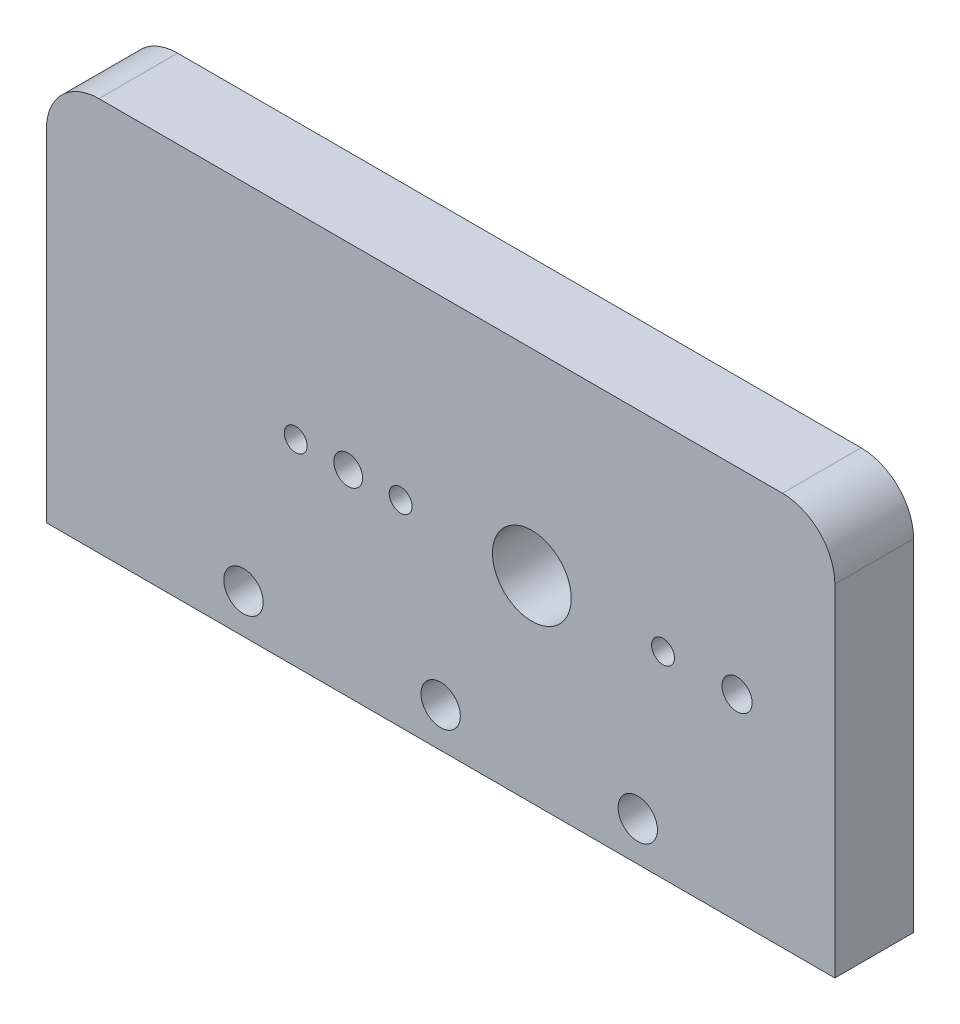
ISO-10303-21;
HEADER;
FILE_DESCRIPTION(('STEP AP214'),'2;1');
FILE_NAME('part.step','',(''),(''),'','','');
FILE_SCHEMA(('AUTOMOTIVE_DESIGN { 1 0 10303 214 1 1 1 1 }'));
ENDSEC;
DATA;
#1=APPLICATION_CONTEXT('core data for automotive mechanical design processes');
#2=APPLICATION_PROTOCOL_DEFINITION('international standard','automotive_design',2000,#1);
#3=PRODUCT_CONTEXT('',#1,'mechanical');
#4=PRODUCT('Part','Part','',(#3));
#5=PRODUCT_RELATED_PRODUCT_CATEGORY('part','',(#4));
#6=PRODUCT_DEFINITION_FORMATION('','',#4);
#7=PRODUCT_DEFINITION_CONTEXT('part definition',#1,'design');
#8=PRODUCT_DEFINITION('design','',#6,#7);
#9=PRODUCT_DEFINITION_SHAPE('','',#8);
#10=(LENGTH_UNIT() NAMED_UNIT(*) SI_UNIT(.MILLI.,.METRE.));
#11=(NAMED_UNIT(*) PLANE_ANGLE_UNIT() SI_UNIT($,.RADIAN.));
#12=(NAMED_UNIT(*) SI_UNIT($,.STERADIAN.) SOLID_ANGLE_UNIT());
#13=UNCERTAINTY_MEASURE_WITH_UNIT(LENGTH_MEASURE(1.E-05),#10,'distance_accuracy_value','');
#14=(GEOMETRIC_REPRESENTATION_CONTEXT(3) GLOBAL_UNCERTAINTY_ASSIGNED_CONTEXT((#13)) GLOBAL_UNIT_ASSIGNED_CONTEXT((#10,
#11,#12)) REPRESENTATION_CONTEXT('',''));
#15=CARTESIAN_POINT('',(0.,0.,0.));
#16=DIRECTION('',(0.,0.,1.));
#17=DIRECTION('',(1.,0.,0.));
#18=AXIS2_PLACEMENT_3D('',#15,#16,#17);
#19=CARTESIAN_POINT('',(34.03975457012,22.0283619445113,6.));
#20=DIRECTION('',(0.,0.,1.));
#21=DIRECTION('',(1.,0.,0.));
#22=AXIS2_PLACEMENT_3D('',#19,#20,#21);
#23=PLANE('',#22);
#24=CARTESIAN_POINT('',(7.99095550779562,-0.971638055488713,6.));
#25=DIRECTION('',(0.,0.,1.));
#26=DIRECTION('',(1.,0.,0.));
#27=AXIS2_PLACEMENT_3D('',#24,#25,#26);
#28=CIRCLE('',#27,1.5);
#29=CARTESIAN_POINT('',(9.49095550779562,-0.971638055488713,6.));
#30=VERTEX_POINT('',#29);
#31=EDGE_CURVE('E207',#30,#30,#28,.T.);
#32=ORIENTED_EDGE('',*,*,#31,.F.);
#33=EDGE_LOOP('',(#32));
#34=FACE_BOUND('',#33,.T.);
#35=CARTESIAN_POINT('',(30.5821564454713,11.0283619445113,6.));
#36=DIRECTION('',(0.,0.,1.));
#37=DIRECTION('',(1.,0.,0.));
#38=AXIS2_PLACEMENT_3D('',#35,#36,#37);
#39=CIRCLE('',#38,1.15);
#40=CARTESIAN_POINT('',(31.7321564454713,11.0283619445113,6.));
#41=VERTEX_POINT('',#40);
#42=EDGE_CURVE('E219',#41,#41,#39,.T.);
#43=ORIENTED_EDGE('',*,*,#42,.F.);
#44=EDGE_LOOP('',(#43));
#45=FACE_BOUND('',#44,.T.);
#46=CARTESIAN_POINT('',(-3.05784355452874,11.0283619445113,6.));
#47=DIRECTION('',(0.,0.,1.));
#48=DIRECTION('',(1.,0.,0.));
#49=AXIS2_PLACEMENT_3D('',#46,#47,#48);
#50=CIRCLE('',#49,0.869999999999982);
#51=CARTESIAN_POINT('',(-2.18784355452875,11.0283619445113,6.));
#52=VERTEX_POINT('',#51);
#53=EDGE_CURVE('E231',#52,#52,#50,.T.);
#54=ORIENTED_EDGE('',*,*,#53,.F.);
#55=EDGE_LOOP('',(#54));
#56=FACE_BOUND('',#55,.T.);
#57=CARTESIAN_POINT('',(4.94215644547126,11.0283619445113,6.));
#58=DIRECTION('',(0.,0.,1.));
#59=DIRECTION('',(1.,0.,0.));
#60=AXIS2_PLACEMENT_3D('',#57,#58,#59);
#61=CIRCLE('',#60,0.87);
#62=CARTESIAN_POINT('',(5.81215644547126,11.0283619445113,6.));
#63=VERTEX_POINT('',#62);
#64=EDGE_CURVE('E243',#63,#63,#61,.T.);
#65=ORIENTED_EDGE('',*,*,#64,.F.);
#66=EDGE_LOOP('',(#65));
#67=FACE_BOUND('',#66,.T.);
#68=DIRECTION('',(0.,-1.,0.));
#69=VECTOR('',#68,1.);
#70=CARTESIAN_POINT('',(-22.0578435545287,22.0283619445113,6.));
#71=LINE('',#70,#69);
#72=CARTESIAN_POINT('',(-22.0578435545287,22.0283619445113,6.));
#73=VERTEX_POINT('',#72);
#74=CARTESIAN_POINT('',(-22.0578435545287,-3.97163805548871,6.));
#75=VERTEX_POINT('',#74);
#76=EDGE_CURVE('E126',#73,#75,#71,.T.);
#77=ORIENTED_EDGE('',*,*,#76,.T.);
#78=DIRECTION('',(1.,0.,0.));
#79=VECTOR('',#78,1.);
#80=CARTESIAN_POINT('',(38.03975457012,-3.97163805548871,6.));
#81=LINE('',#80,#79);
#82=CARTESIAN_POINT('',(38.03975457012,-3.97163805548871,6.));
#83=VERTEX_POINT('',#82);
#84=EDGE_CURVE('E84',#75,#83,#81,.T.);
#85=ORIENTED_EDGE('',*,*,#84,.T.);
#86=DIRECTION('',(0.,1.,0.));
#87=VECTOR('',#86,1.);
#88=CARTESIAN_POINT('',(38.03975457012,-3.97163805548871,6.));
#89=LINE('',#88,#87);
#90=CARTESIAN_POINT('',(38.03975457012,22.0283619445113,6.));
#91=VERTEX_POINT('',#90);
#92=EDGE_CURVE('E97',#83,#91,#89,.T.);
#93=ORIENTED_EDGE('',*,*,#92,.T.);
#94=CARTESIAN_POINT('',(34.03975457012,22.0283619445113,6.));
#95=DIRECTION('',(0.,0.,1.));
#96=DIRECTION('',(1.,0.,0.));
#97=AXIS2_PLACEMENT_3D('',#94,#95,#96);
#98=CIRCLE('',#97,4.);
#99=CARTESIAN_POINT('',(34.03975457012,26.0283619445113,6.));
#100=VERTEX_POINT('',#99);
#101=EDGE_CURVE('E91',#91,#100,#98,.T.);
#102=ORIENTED_EDGE('',*,*,#101,.T.);
#103=DIRECTION('',(-1.,0.,0.));
#104=VECTOR('',#103,1.);
#105=CARTESIAN_POINT('',(34.03975457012,26.0283619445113,6.));
#106=LINE('',#105,#104);
#107=CARTESIAN_POINT('',(-18.0578435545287,26.0283619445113,6.));
#108=VERTEX_POINT('',#107);
#109=EDGE_CURVE('E95',#100,#108,#106,.T.);
#110=ORIENTED_EDGE('',*,*,#109,.T.);
#111=CARTESIAN_POINT('',(-18.0578435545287,22.0283619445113,6.));
#112=DIRECTION('',(0.,0.,1.));
#113=DIRECTION('',(-1.,0.,0.));
#114=AXIS2_PLACEMENT_3D('',#111,#112,#113);
#115=CIRCLE('',#114,4.);
#116=EDGE_CURVE('E47',#108,#73,#115,.T.);
#117=ORIENTED_EDGE('',*,*,#116,.T.);
#118=EDGE_LOOP('',(#77,#85,#93,#102,#110,#117));
#119=FACE_BOUND('',#118,.T.);
#120=CARTESIAN_POINT('',(14.9421564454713,11.0283619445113,6.));
#121=DIRECTION('',(0.,0.,1.));
#122=DIRECTION('',(1.,0.,0.));
#123=AXIS2_PLACEMENT_3D('',#120,#121,#122);
#124=CIRCLE('',#123,3.);
#125=CARTESIAN_POINT('',(17.9421564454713,11.0283619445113,6.));
#126=VERTEX_POINT('',#125);
#127=EDGE_CURVE('E119',#126,#126,#124,.T.);
#128=ORIENTED_EDGE('',*,*,#127,.F.);
#129=EDGE_LOOP('',(#128));
#130=FACE_BOUND('',#129,.T.);
#131=CARTESIAN_POINT('',(0.942156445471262,11.0283619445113,6.));
#132=DIRECTION('',(0.,0.,1.));
#133=DIRECTION('',(1.,0.,0.));
#134=AXIS2_PLACEMENT_3D('',#131,#132,#133);
#135=CIRCLE('',#134,1.1);
#136=CARTESIAN_POINT('',(2.04215644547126,11.0283619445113,6.));
#137=VERTEX_POINT('',#136);
#138=EDGE_CURVE('E237',#137,#137,#135,.T.);
#139=ORIENTED_EDGE('',*,*,#138,.F.);
#140=EDGE_LOOP('',(#139));
#141=FACE_BOUND('',#140,.T.);
#142=CARTESIAN_POINT('',(24.9421564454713,11.0283619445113,6.));
#143=DIRECTION('',(0.,0.,1.));
#144=DIRECTION('',(1.,0.,0.));
#145=AXIS2_PLACEMENT_3D('',#142,#143,#144);
#146=CIRCLE('',#145,0.870000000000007);
#147=CARTESIAN_POINT('',(25.8121564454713,11.0283619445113,6.));
#148=VERTEX_POINT('',#147);
#149=EDGE_CURVE('E225',#148,#148,#146,.T.);
#150=ORIENTED_EDGE('',*,*,#149,.F.);
#151=EDGE_LOOP('',(#150));
#152=FACE_BOUND('',#151,.T.);
#153=CARTESIAN_POINT('',(23.0153550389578,-0.971638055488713,6.));
#154=DIRECTION('',(0.,0.,1.));
#155=DIRECTION('',(1.,0.,0.));
#156=AXIS2_PLACEMENT_3D('',#153,#154,#155);
#157=CIRCLE('',#156,1.5);
#158=CARTESIAN_POINT('',(24.5153550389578,-0.971638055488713,6.));
#159=VERTEX_POINT('',#158);
#160=EDGE_CURVE('E213',#159,#159,#157,.T.);
#161=ORIENTED_EDGE('',*,*,#160,.F.);
#162=EDGE_LOOP('',(#161));
#163=FACE_BOUND('',#162,.T.);
#164=CARTESIAN_POINT('',(-7.03344402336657,-0.971638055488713,6.));
#165=DIRECTION('',(0.,0.,1.));
#166=DIRECTION('',(-1.,0.,0.));
#167=AXIS2_PLACEMENT_3D('',#164,#165,#166);
#168=CIRCLE('',#167,1.5);
#169=CARTESIAN_POINT('',(-8.53344402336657,-0.971638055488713,6.));
#170=VERTEX_POINT('',#169);
#171=EDGE_CURVE('E198',#170,#170,#168,.T.);
#172=ORIENTED_EDGE('',*,*,#171,.F.);
#173=EDGE_LOOP('',(#172));
#174=FACE_BOUND('',#173,.T.);
#175=ADVANCED_FACE('F30',(#34,#45,#56,#67,#119,#130,#141,#152,#163,#174),#23,.T.);
#176=CARTESIAN_POINT('',(34.03975457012,22.0283619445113,0.));
#177=DIRECTION('',(0.,0.,1.));
#178=DIRECTION('',(1.,0.,0.));
#179=AXIS2_PLACEMENT_3D('',#176,#177,#178);
#180=PLANE('',#179);
#181=CARTESIAN_POINT('',(7.99095550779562,-0.971638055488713,0.));
#182=DIRECTION('',(0.,0.,1.));
#183=DIRECTION('',(1.,0.,0.));
#184=AXIS2_PLACEMENT_3D('',#181,#182,#183);
#185=CIRCLE('',#184,1.5);
#186=CARTESIAN_POINT('',(9.49095550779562,-0.971638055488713,0.));
#187=VERTEX_POINT('',#186);
#188=EDGE_CURVE('E204',#187,#187,#185,.T.);
#189=ORIENTED_EDGE('',*,*,#188,.T.);
#190=EDGE_LOOP('',(#189));
#191=FACE_BOUND('',#190,.T.);
#192=CARTESIAN_POINT('',(30.5821564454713,11.0283619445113,0.));
#193=DIRECTION('',(0.,0.,1.));
#194=DIRECTION('',(1.,0.,0.));
#195=AXIS2_PLACEMENT_3D('',#192,#193,#194);
#196=CIRCLE('',#195,1.15);
#197=CARTESIAN_POINT('',(31.7321564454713,11.0283619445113,0.));
#198=VERTEX_POINT('',#197);
#199=EDGE_CURVE('E216',#198,#198,#196,.T.);
#200=ORIENTED_EDGE('',*,*,#199,.T.);
#201=EDGE_LOOP('',(#200));
#202=FACE_BOUND('',#201,.T.);
#203=CARTESIAN_POINT('',(-3.05784355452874,11.0283619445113,0.));
#204=DIRECTION('',(0.,0.,1.));
#205=DIRECTION('',(1.,0.,0.));
#206=AXIS2_PLACEMENT_3D('',#203,#204,#205);
#207=CIRCLE('',#206,0.869999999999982);
#208=CARTESIAN_POINT('',(-2.18784355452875,11.0283619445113,0.));
#209=VERTEX_POINT('',#208);
#210=EDGE_CURVE('E228',#209,#209,#207,.T.);
#211=ORIENTED_EDGE('',*,*,#210,.T.);
#212=EDGE_LOOP('',(#211));
#213=FACE_BOUND('',#212,.T.);
#214=CARTESIAN_POINT('',(4.94215644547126,11.0283619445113,0.));
#215=DIRECTION('',(0.,0.,1.));
#216=DIRECTION('',(1.,0.,0.));
#217=AXIS2_PLACEMENT_3D('',#214,#215,#216);
#218=CIRCLE('',#217,0.87);
#219=CARTESIAN_POINT('',(5.81215644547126,11.0283619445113,0.));
#220=VERTEX_POINT('',#219);
#221=EDGE_CURVE('E240',#220,#220,#218,.T.);
#222=ORIENTED_EDGE('',*,*,#221,.T.);
#223=EDGE_LOOP('',(#222));
#224=FACE_BOUND('',#223,.T.);
#225=DIRECTION('',(0.,-1.,0.));
#226=VECTOR('',#225,1.);
#227=CARTESIAN_POINT('',(-22.0578435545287,22.0283619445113,0.));
#228=LINE('',#227,#226);
#229=CARTESIAN_POINT('',(-22.0578435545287,22.0283619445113,0.));
#230=VERTEX_POINT('',#229);
#231=CARTESIAN_POINT('',(-22.0578435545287,-3.97163805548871,0.));
#232=VERTEX_POINT('',#231);
#233=EDGE_CURVE('E115',#230,#232,#228,.T.);
#234=ORIENTED_EDGE('',*,*,#233,.F.);
#235=CARTESIAN_POINT('',(-18.0578435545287,22.0283619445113,0.));
#236=DIRECTION('',(0.,0.,1.));
#237=DIRECTION('',(-1.,0.,0.));
#238=AXIS2_PLACEMENT_3D('',#235,#236,#237);
#239=CIRCLE('',#238,4.);
#240=CARTESIAN_POINT('',(-18.0578435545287,26.0283619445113,0.));
#241=VERTEX_POINT('',#240);
#242=EDGE_CURVE('E76',#241,#230,#239,.T.);
#243=ORIENTED_EDGE('',*,*,#242,.F.);
#244=DIRECTION('',(-1.,0.,0.));
#245=VECTOR('',#244,1.);
#246=CARTESIAN_POINT('',(34.03975457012,26.0283619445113,0.));
#247=LINE('',#246,#245);
#248=CARTESIAN_POINT('',(34.03975457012,26.0283619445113,0.));
#249=VERTEX_POINT('',#248);
#250=EDGE_CURVE('E70',#249,#241,#247,.T.);
#251=ORIENTED_EDGE('',*,*,#250,.F.);
#252=CARTESIAN_POINT('',(34.03975457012,22.0283619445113,0.));
#253=DIRECTION('',(0.,0.,1.));
#254=DIRECTION('',(1.,0.,0.));
#255=AXIS2_PLACEMENT_3D('',#252,#253,#254);
#256=CIRCLE('',#255,4.);
#257=CARTESIAN_POINT('',(38.03975457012,22.0283619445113,0.));
#258=VERTEX_POINT('',#257);
#259=EDGE_CURVE('E105',#258,#249,#256,.T.);
#260=ORIENTED_EDGE('',*,*,#259,.F.);
#261=DIRECTION('',(0.,1.,0.));
#262=VECTOR('',#261,1.);
#263=CARTESIAN_POINT('',(38.03975457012,-3.97163805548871,0.));
#264=LINE('',#263,#262);
#265=CARTESIAN_POINT('',(38.03975457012,-3.97163805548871,0.));
#266=VERTEX_POINT('',#265);
#267=EDGE_CURVE('E121',#266,#258,#264,.T.);
#268=ORIENTED_EDGE('',*,*,#267,.F.);
#269=DIRECTION('',(1.,0.,0.));
#270=VECTOR('',#269,1.);
#271=CARTESIAN_POINT('',(38.03975457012,-3.97163805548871,0.));
#272=LINE('',#271,#270);
#273=EDGE_CURVE('E118',#232,#266,#272,.T.);
#274=ORIENTED_EDGE('',*,*,#273,.F.);
#275=EDGE_LOOP('',(#234,#243,#251,#260,#268,#274));
#276=FACE_BOUND('',#275,.T.);
#277=CARTESIAN_POINT('',(14.9421564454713,11.0283619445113,0.));
#278=DIRECTION('',(0.,0.,1.));
#279=DIRECTION('',(1.,0.,0.));
#280=AXIS2_PLACEMENT_3D('',#277,#278,#279);
#281=CIRCLE('',#280,3.);
#282=CARTESIAN_POINT('',(17.9421564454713,11.0283619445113,0.));
#283=VERTEX_POINT('',#282);
#284=EDGE_CURVE('E246',#283,#283,#281,.T.);
#285=ORIENTED_EDGE('',*,*,#284,.T.);
#286=EDGE_LOOP('',(#285));
#287=FACE_BOUND('',#286,.T.);
#288=CARTESIAN_POINT('',(0.942156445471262,11.0283619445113,0.));
#289=DIRECTION('',(0.,0.,1.));
#290=DIRECTION('',(1.,0.,0.));
#291=AXIS2_PLACEMENT_3D('',#288,#289,#290);
#292=CIRCLE('',#291,1.1);
#293=CARTESIAN_POINT('',(2.04215644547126,11.0283619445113,0.));
#294=VERTEX_POINT('',#293);
#295=EDGE_CURVE('E234',#294,#294,#292,.T.);
#296=ORIENTED_EDGE('',*,*,#295,.T.);
#297=EDGE_LOOP('',(#296));
#298=FACE_BOUND('',#297,.T.);
#299=CARTESIAN_POINT('',(24.9421564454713,11.0283619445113,0.));
#300=DIRECTION('',(0.,0.,1.));
#301=DIRECTION('',(1.,0.,0.));
#302=AXIS2_PLACEMENT_3D('',#299,#300,#301);
#303=CIRCLE('',#302,0.870000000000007);
#304=CARTESIAN_POINT('',(25.8121564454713,11.0283619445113,0.));
#305=VERTEX_POINT('',#304);
#306=EDGE_CURVE('E222',#305,#305,#303,.T.);
#307=ORIENTED_EDGE('',*,*,#306,.T.);
#308=EDGE_LOOP('',(#307));
#309=FACE_BOUND('',#308,.T.);
#310=CARTESIAN_POINT('',(23.0153550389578,-0.971638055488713,0.));
#311=DIRECTION('',(0.,0.,1.));
#312=DIRECTION('',(1.,0.,0.));
#313=AXIS2_PLACEMENT_3D('',#310,#311,#312);
#314=CIRCLE('',#313,1.5);
#315=CARTESIAN_POINT('',(24.5153550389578,-0.971638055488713,0.));
#316=VERTEX_POINT('',#315);
#317=EDGE_CURVE('E210',#316,#316,#314,.T.);
#318=ORIENTED_EDGE('',*,*,#317,.T.);
#319=EDGE_LOOP('',(#318));
#320=FACE_BOUND('',#319,.T.);
#321=CARTESIAN_POINT('',(-7.03344402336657,-0.971638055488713,0.));
#322=DIRECTION('',(0.,0.,1.));
#323=DIRECTION('',(-1.,0.,0.));
#324=AXIS2_PLACEMENT_3D('',#321,#322,#323);
#325=CIRCLE('',#324,1.5);
#326=CARTESIAN_POINT('',(-8.53344402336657,-0.971638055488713,0.));
#327=VERTEX_POINT('',#326);
#328=EDGE_CURVE('E201',#327,#327,#325,.T.);
#329=ORIENTED_EDGE('',*,*,#328,.T.);
#330=EDGE_LOOP('',(#329));
#331=FACE_BOUND('',#330,.T.);
#332=ADVANCED_FACE('F135',(#191,#202,#213,#224,#276,#287,#298,#309,#320,#331),#180,.F.);
#333=CARTESIAN_POINT('',(-22.0578435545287,22.0283619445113,6.));
#334=DIRECTION('',(1.,0.,0.));
#335=DIRECTION('',(0.,1.,0.));
#336=AXIS2_PLACEMENT_3D('',#333,#334,#335);
#337=PLANE('',#336);
#338=ORIENTED_EDGE('',*,*,#233,.T.);
#339=DIRECTION('',(0.,0.,-1.));
#340=VECTOR('',#339,1.);
#341=CARTESIAN_POINT('',(-22.0578435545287,-3.97163805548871,6.));
#342=LINE('',#341,#340);
#343=EDGE_CURVE('E11',#75,#232,#342,.T.);
#344=ORIENTED_EDGE('',*,*,#343,.F.);
#345=ORIENTED_EDGE('',*,*,#76,.F.);
#346=DIRECTION('',(0.,0.,-1.));
#347=VECTOR('',#346,1.);
#348=CARTESIAN_POINT('',(-22.0578435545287,22.0283619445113,6.));
#349=LINE('',#348,#347);
#350=EDGE_CURVE('E111',#73,#230,#349,.T.);
#351=ORIENTED_EDGE('',*,*,#350,.T.);
#352=EDGE_LOOP('',(#338,#344,#345,#351));
#353=FACE_BOUND('',#352,.T.);
#354=ADVANCED_FACE('F32',(#353),#337,.F.);
#355=CARTESIAN_POINT('',(38.03975457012,-3.97163805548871,6.));
#356=DIRECTION('',(0.,1.,0.));
#357=DIRECTION('',(-1.,0.,0.));
#358=AXIS2_PLACEMENT_3D('',#355,#356,#357);
#359=PLANE('',#358);
#360=ORIENTED_EDGE('',*,*,#273,.T.);
#361=DIRECTION('',(0.,0.,-1.));
#362=VECTOR('',#361,1.);
#363=CARTESIAN_POINT('',(38.03975457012,-3.97163805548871,6.));
#364=LINE('',#363,#362);
#365=EDGE_CURVE('E39',#83,#266,#364,.T.);
#366=ORIENTED_EDGE('',*,*,#365,.F.);
#367=ORIENTED_EDGE('',*,*,#84,.F.);
#368=ORIENTED_EDGE('',*,*,#343,.T.);
#369=EDGE_LOOP('',(#360,#366,#367,#368));
#370=FACE_BOUND('',#369,.T.);
#371=ADVANCED_FACE('F348',(#370),#359,.F.);
#372=CARTESIAN_POINT('',(38.03975457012,-3.97163805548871,6.));
#373=DIRECTION('',(-1.,0.,0.));
#374=DIRECTION('',(0.,0.,1.));
#375=AXIS2_PLACEMENT_3D('',#372,#373,#374);
#376=PLANE('',#375);
#377=ORIENTED_EDGE('',*,*,#267,.T.);
#378=DIRECTION('',(0.,0.,-1.));
#379=VECTOR('',#378,1.);
#380=CARTESIAN_POINT('',(38.03975457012,22.0283619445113,6.));
#381=LINE('',#380,#379);
#382=EDGE_CURVE('E106',#91,#258,#381,.T.);
#383=ORIENTED_EDGE('',*,*,#382,.F.);
#384=ORIENTED_EDGE('',*,*,#92,.F.);
#385=ORIENTED_EDGE('',*,*,#365,.T.);
#386=EDGE_LOOP('',(#377,#383,#384,#385));
#387=FACE_BOUND('',#386,.T.);
#388=ADVANCED_FACE('F132',(#387),#376,.F.);
#389=CARTESIAN_POINT('',(34.03975457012,22.0283619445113,6.));
#390=DIRECTION('',(0.,0.,-1.));
#391=DIRECTION('',(-1.,0.,0.));
#392=AXIS2_PLACEMENT_3D('',#389,#390,#391);
#393=CYLINDRICAL_SURFACE('',#392,4.);
#394=ORIENTED_EDGE('',*,*,#259,.T.);
#395=DIRECTION('',(0.,0.,-1.));
#396=VECTOR('',#395,1.);
#397=CARTESIAN_POINT('',(34.03975457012,26.0283619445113,6.));
#398=LINE('',#397,#396);
#399=EDGE_CURVE('E102',#100,#249,#398,.T.);
#400=ORIENTED_EDGE('',*,*,#399,.F.);
#401=ORIENTED_EDGE('',*,*,#101,.F.);
#402=ORIENTED_EDGE('',*,*,#382,.T.);
#403=EDGE_LOOP('',(#394,#400,#401,#402));
#404=FACE_BOUND('',#403,.T.);
#405=ADVANCED_FACE('F103',(#404),#393,.T.);
#406=CARTESIAN_POINT('',(34.03975457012,26.0283619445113,6.));
#407=DIRECTION('',(0.,-1.,0.));
#408=DIRECTION('',(1.,0.,0.));
#409=AXIS2_PLACEMENT_3D('',#406,#407,#408);
#410=PLANE('',#409);
#411=ORIENTED_EDGE('',*,*,#250,.T.);
#412=DIRECTION('',(0.,0.,-1.));
#413=VECTOR('',#412,1.);
#414=CARTESIAN_POINT('',(-18.0578435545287,26.0283619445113,6.));
#415=LINE('',#414,#413);
#416=EDGE_CURVE('E107',#108,#241,#415,.T.);
#417=ORIENTED_EDGE('',*,*,#416,.F.);
#418=ORIENTED_EDGE('',*,*,#109,.F.);
#419=ORIENTED_EDGE('',*,*,#399,.T.);
#420=EDGE_LOOP('',(#411,#417,#418,#419));
#421=FACE_BOUND('',#420,.T.);
#422=ADVANCED_FACE('F109',(#421),#410,.F.);
#423=CARTESIAN_POINT('',(-18.0578435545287,22.0283619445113,6.));
#424=DIRECTION('',(0.,0.,-1.));
#425=DIRECTION('',(-1.,0.,0.));
#426=AXIS2_PLACEMENT_3D('',#423,#424,#425);
#427=CYLINDRICAL_SURFACE('',#426,4.);
#428=ORIENTED_EDGE('',*,*,#242,.T.);
#429=ORIENTED_EDGE('',*,*,#350,.F.);
#430=ORIENTED_EDGE('',*,*,#116,.F.);
#431=ORIENTED_EDGE('',*,*,#416,.T.);
#432=EDGE_LOOP('',(#428,#429,#430,#431));
#433=FACE_BOUND('',#432,.T.);
#434=ADVANCED_FACE('F140',(#433),#427,.T.);
#435=CARTESIAN_POINT('',(14.9421564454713,11.0283619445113,6.));
#436=DIRECTION('',(0.,0.,-1.));
#437=DIRECTION('',(-1.,0.,0.));
#438=AXIS2_PLACEMENT_3D('',#435,#436,#437);
#439=CYLINDRICAL_SURFACE('',#438,3.);
#440=ORIENTED_EDGE('',*,*,#127,.T.);
#441=EDGE_LOOP('',(#440));
#442=FACE_BOUND('',#441,.T.);
#443=ORIENTED_EDGE('',*,*,#284,.F.);
#444=EDGE_LOOP('',(#443));
#445=FACE_BOUND('',#444,.T.);
#446=ADVANCED_FACE('F142',(#442,#445),#439,.F.);
#447=CARTESIAN_POINT('',(4.94215644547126,11.0283619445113,6.));
#448=DIRECTION('',(0.,0.,-1.));
#449=DIRECTION('',(-1.,0.,0.));
#450=AXIS2_PLACEMENT_3D('',#447,#448,#449);
#451=CYLINDRICAL_SURFACE('',#450,0.87);
#452=ORIENTED_EDGE('',*,*,#64,.T.);
#453=EDGE_LOOP('',(#452));
#454=FACE_BOUND('',#453,.T.);
#455=ORIENTED_EDGE('',*,*,#221,.F.);
#456=EDGE_LOOP('',(#455));
#457=FACE_BOUND('',#456,.T.);
#458=ADVANCED_FACE('F148',(#454,#457),#451,.F.);
#459=CARTESIAN_POINT('',(0.942156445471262,11.0283619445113,6.));
#460=DIRECTION('',(0.,0.,-1.));
#461=DIRECTION('',(-1.,0.,0.));
#462=AXIS2_PLACEMENT_3D('',#459,#460,#461);
#463=CYLINDRICAL_SURFACE('',#462,1.1);
#464=ORIENTED_EDGE('',*,*,#138,.T.);
#465=EDGE_LOOP('',(#464));
#466=FACE_BOUND('',#465,.T.);
#467=ORIENTED_EDGE('',*,*,#295,.F.);
#468=EDGE_LOOP('',(#467));
#469=FACE_BOUND('',#468,.T.);
#470=ADVANCED_FACE('F165',(#466,#469),#463,.F.);
#471=CARTESIAN_POINT('',(-3.05784355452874,11.0283619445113,6.));
#472=DIRECTION('',(0.,0.,-1.));
#473=DIRECTION('',(-1.,0.,0.));
#474=AXIS2_PLACEMENT_3D('',#471,#472,#473);
#475=CYLINDRICAL_SURFACE('',#474,0.869999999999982);
#476=ORIENTED_EDGE('',*,*,#53,.T.);
#477=EDGE_LOOP('',(#476));
#478=FACE_BOUND('',#477,.T.);
#479=ORIENTED_EDGE('',*,*,#210,.F.);
#480=EDGE_LOOP('',(#479));
#481=FACE_BOUND('',#480,.T.);
#482=ADVANCED_FACE('F169',(#478,#481),#475,.F.);
#483=CARTESIAN_POINT('',(24.9421564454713,11.0283619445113,6.));
#484=DIRECTION('',(0.,0.,-1.));
#485=DIRECTION('',(-1.,0.,0.));
#486=AXIS2_PLACEMENT_3D('',#483,#484,#485);
#487=CYLINDRICAL_SURFACE('',#486,0.870000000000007);
#488=ORIENTED_EDGE('',*,*,#149,.T.);
#489=EDGE_LOOP('',(#488));
#490=FACE_BOUND('',#489,.T.);
#491=ORIENTED_EDGE('',*,*,#306,.F.);
#492=EDGE_LOOP('',(#491));
#493=FACE_BOUND('',#492,.T.);
#494=ADVANCED_FACE('F173',(#490,#493),#487,.F.);
#495=CARTESIAN_POINT('',(30.5821564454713,11.0283619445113,6.));
#496=DIRECTION('',(0.,0.,-1.));
#497=DIRECTION('',(-1.,0.,0.));
#498=AXIS2_PLACEMENT_3D('',#495,#496,#497);
#499=CYLINDRICAL_SURFACE('',#498,1.15);
#500=ORIENTED_EDGE('',*,*,#42,.T.);
#501=EDGE_LOOP('',(#500));
#502=FACE_BOUND('',#501,.T.);
#503=ORIENTED_EDGE('',*,*,#199,.F.);
#504=EDGE_LOOP('',(#503));
#505=FACE_BOUND('',#504,.T.);
#506=ADVANCED_FACE('F177',(#502,#505),#499,.F.);
#507=CARTESIAN_POINT('',(23.0153550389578,-0.971638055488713,6.));
#508=DIRECTION('',(0.,0.,-1.));
#509=DIRECTION('',(-1.,0.,0.));
#510=AXIS2_PLACEMENT_3D('',#507,#508,#509);
#511=CYLINDRICAL_SURFACE('',#510,1.5);
#512=ORIENTED_EDGE('',*,*,#160,.T.);
#513=EDGE_LOOP('',(#512));
#514=FACE_BOUND('',#513,.T.);
#515=ORIENTED_EDGE('',*,*,#317,.F.);
#516=EDGE_LOOP('',(#515));
#517=FACE_BOUND('',#516,.T.);
#518=ADVANCED_FACE('F181',(#514,#517),#511,.F.);
#519=CARTESIAN_POINT('',(7.99095550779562,-0.971638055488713,6.));
#520=DIRECTION('',(0.,0.,-1.));
#521=DIRECTION('',(-1.,0.,0.));
#522=AXIS2_PLACEMENT_3D('',#519,#520,#521);
#523=CYLINDRICAL_SURFACE('',#522,1.5);
#524=ORIENTED_EDGE('',*,*,#31,.T.);
#525=EDGE_LOOP('',(#524));
#526=FACE_BOUND('',#525,.T.);
#527=ORIENTED_EDGE('',*,*,#188,.F.);
#528=EDGE_LOOP('',(#527));
#529=FACE_BOUND('',#528,.T.);
#530=ADVANCED_FACE('F185',(#526,#529),#523,.F.);
#531=CARTESIAN_POINT('',(-7.03344402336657,-0.971638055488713,6.));
#532=DIRECTION('',(0.,0.,-1.));
#533=DIRECTION('',(-1.,0.,0.));
#534=AXIS2_PLACEMENT_3D('',#531,#532,#533);
#535=CYLINDRICAL_SURFACE('',#534,1.5);
#536=ORIENTED_EDGE('',*,*,#171,.T.);
#537=EDGE_LOOP('',(#536));
#538=FACE_BOUND('',#537,.T.);
#539=ORIENTED_EDGE('',*,*,#328,.F.);
#540=EDGE_LOOP('',(#539));
#541=FACE_BOUND('',#540,.T.);
#542=ADVANCED_FACE('F189',(#538,#541),#535,.F.);
#543=CLOSED_SHELL('',(#175,#332,#354,#371,#388,#405,#422,#434,#446,#458,#470,#482,#494,#506,
#518,#530,#542));
#544=MANIFOLD_SOLID_BREP('B2',#543);
#545=ADVANCED_BREP_SHAPE_REPRESENTATION('',(#18,#544),#14);
#546=SHAPE_DEFINITION_REPRESENTATION(#9,#545);
ENDSEC;
END-ISO-10303-21;
